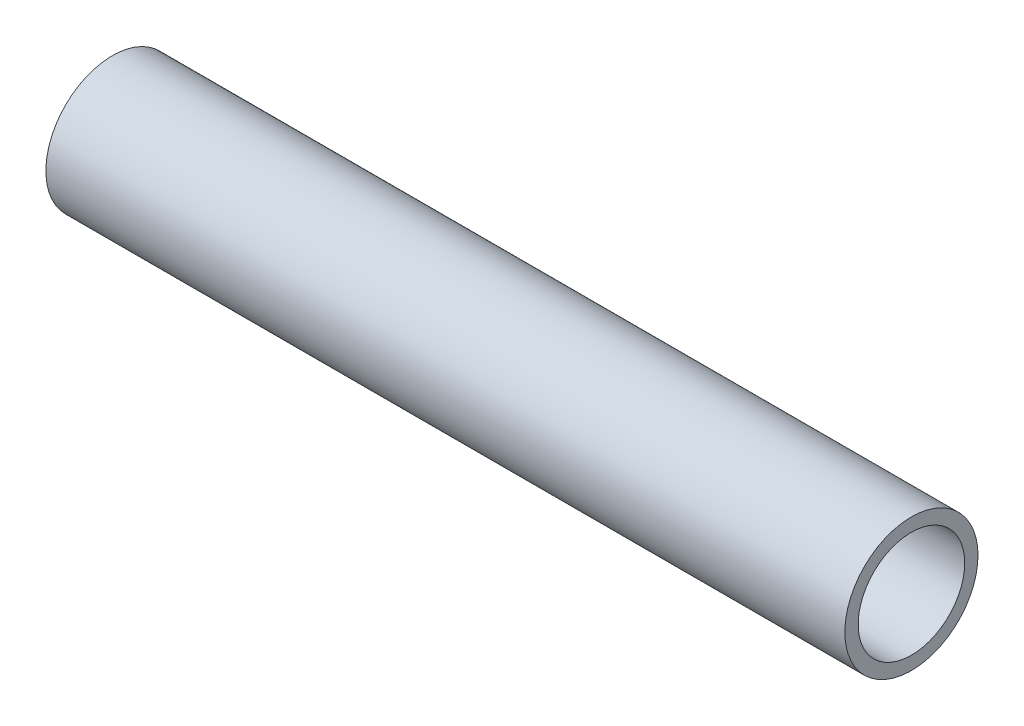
from build123d import *

# Parameters (mm, degrees)
ESQUISSE1_R        = 5
ESQUISSE1_R_2      = 4
BOSS_EXTRU_1_DEPTH = 30


with BuildPart() as part:
    # Esquisse1 → Boss.-Extru.1 (new, symmetric)
    with BuildSketch(Plane(origin=(0, 0, 0), x_dir=(0, 0, -1), z_dir=(1, 0, 0))):
        Circle(ESQUISSE1_R)
        Circle(ESQUISSE1_R_2, mode=Mode.SUBTRACT)
    extrude(amount=BOSS_EXTRU_1_DEPTH, both=True)


solid = part.part
